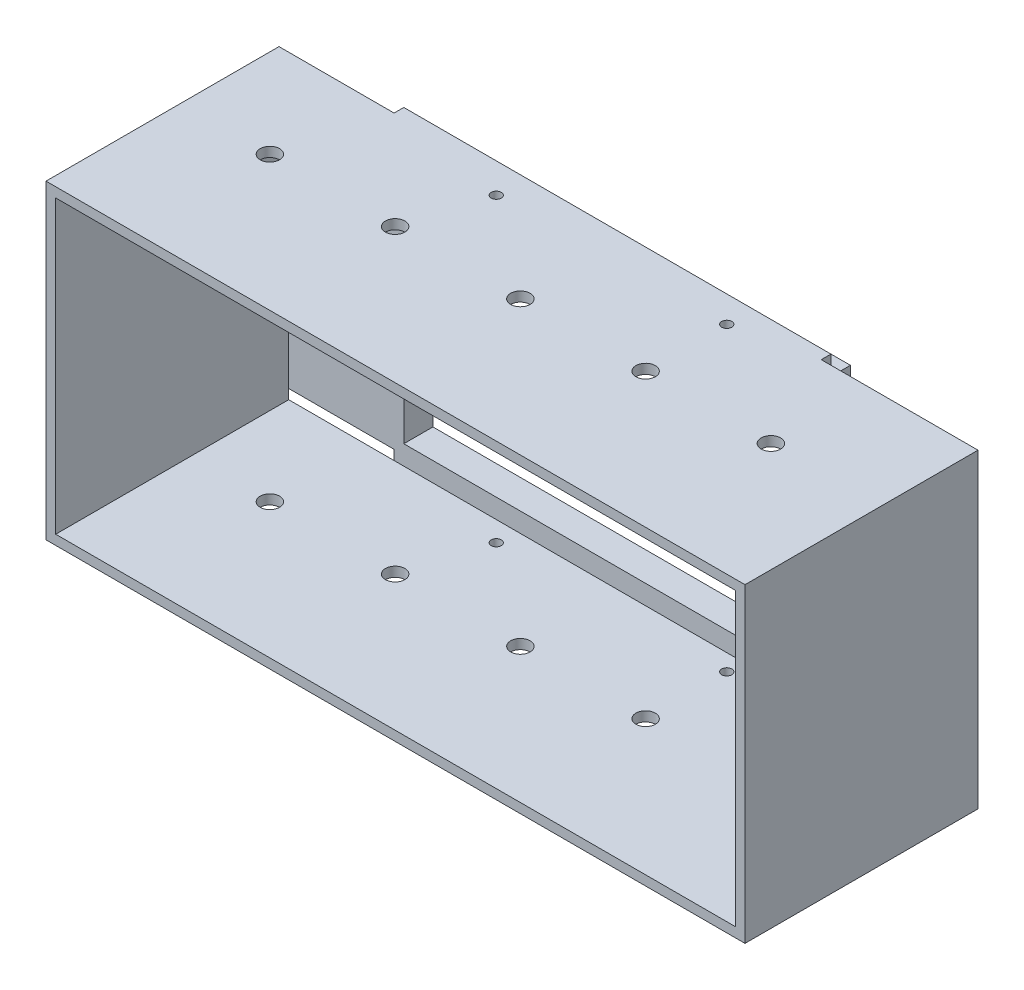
ISO-10303-21;
HEADER;
FILE_DESCRIPTION(('STEP AP214'),'2;1');
FILE_NAME('part.step','',(''),(''),'','','');
FILE_SCHEMA(('AUTOMOTIVE_DESIGN { 1 0 10303 214 1 1 1 1 }'));
ENDSEC;
DATA;
#1=APPLICATION_CONTEXT('core data for automotive mechanical design processes');
#2=APPLICATION_PROTOCOL_DEFINITION('international standard','automotive_design',2000,#1);
#3=PRODUCT_CONTEXT('',#1,'mechanical');
#4=PRODUCT('Part','Part','',(#3));
#5=PRODUCT_RELATED_PRODUCT_CATEGORY('part','',(#4));
#6=PRODUCT_DEFINITION_FORMATION('','',#4);
#7=PRODUCT_DEFINITION_CONTEXT('part definition',#1,'design');
#8=PRODUCT_DEFINITION('design','',#6,#7);
#9=PRODUCT_DEFINITION_SHAPE('','',#8);
#10=(LENGTH_UNIT() NAMED_UNIT(*) SI_UNIT(.MILLI.,.METRE.));
#11=(NAMED_UNIT(*) PLANE_ANGLE_UNIT() SI_UNIT($,.RADIAN.));
#12=(NAMED_UNIT(*) SI_UNIT($,.STERADIAN.) SOLID_ANGLE_UNIT());
#13=UNCERTAINTY_MEASURE_WITH_UNIT(LENGTH_MEASURE(1.E-05),#10,'distance_accuracy_value','');
#14=(GEOMETRIC_REPRESENTATION_CONTEXT(3) GLOBAL_UNCERTAINTY_ASSIGNED_CONTEXT((#13)) GLOBAL_UNIT_ASSIGNED_CONTEXT((#10,
#11,#12)) REPRESENTATION_CONTEXT('',''));
#15=CARTESIAN_POINT('',(0.,0.,0.));
#16=DIRECTION('',(0.,0.,1.));
#17=DIRECTION('',(1.,0.,0.));
#18=AXIS2_PLACEMENT_3D('',#15,#16,#17);
#19=CARTESIAN_POINT('',(-107.315,29.535637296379,3.175));
#20=DIRECTION('',(0.,0.,1.));
#21=DIRECTION('',(1.,0.,0.));
#22=AXIS2_PLACEMENT_3D('',#19,#20,#21);
#23=PLANE('',#22);
#24=DIRECTION('',(1.,0.,0.));
#25=VECTOR('',#24,1.);
#26=CARTESIAN_POINT('',(-66.4957712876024,-56.189362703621,3.175));
#27=LINE('',#26,#25);
#28=CARTESIAN_POINT('',(-66.4957712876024,-56.189362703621,3.175));
#29=VERTEX_POINT('',#28);
#30=CARTESIAN_POINT('',(66.8542287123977,-56.189362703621,3.175));
#31=VERTEX_POINT('',#30);
#32=EDGE_CURVE('E376',#29,#31,#27,.T.);
#33=ORIENTED_EDGE('',*,*,#32,.F.);
#34=DIRECTION('',(0.,-1.,0.));
#35=VECTOR('',#34,1.);
#36=CARTESIAN_POINT('',(-66.4957712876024,26.360637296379,3.175));
#37=LINE('',#36,#35);
#38=CARTESIAN_POINT('',(-66.4957712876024,26.360637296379,3.175));
#39=VERTEX_POINT('',#38);
#40=EDGE_CURVE('E374',#39,#29,#37,.T.);
#41=ORIENTED_EDGE('',*,*,#40,.F.);
#42=DIRECTION('',(-1.,0.,0.));
#43=VECTOR('',#42,1.);
#44=CARTESIAN_POINT('',(-66.4957712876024,26.360637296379,3.175));
#45=LINE('',#44,#43);
#46=CARTESIAN_POINT('',(66.8542287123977,26.360637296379,3.175));
#47=VERTEX_POINT('',#46);
#48=EDGE_CURVE('E381',#47,#39,#45,.T.);
#49=ORIENTED_EDGE('',*,*,#48,.F.);
#50=DIRECTION('',(0.,1.,0.));
#51=VECTOR('',#50,1.);
#52=CARTESIAN_POINT('',(66.8542287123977,26.360637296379,3.175));
#53=LINE('',#52,#51);
#54=EDGE_CURVE('E378',#31,#47,#53,.T.);
#55=ORIENTED_EDGE('',*,*,#54,.F.);
#56=EDGE_LOOP('',(#33,#41,#49,#55));
#57=FACE_BOUND('',#56,.T.);
#58=DIRECTION('',(-1.,0.,0.));
#59=VECTOR('',#58,1.);
#60=CARTESIAN_POINT('',(-69.6707712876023,29.535637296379,3.175));
#61=LINE('',#60,#59);
#62=CARTESIAN_POINT('',(-69.6707712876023,29.535637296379,3.175));
#63=VERTEX_POINT('',#62);
#64=CARTESIAN_POINT('',(-104.14,29.535637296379,3.175));
#65=VERTEX_POINT('',#64);
#66=EDGE_CURVE('E392',#63,#65,#61,.T.);
#67=ORIENTED_EDGE('',*,*,#66,.T.);
#68=DIRECTION('',(0.,-1.,0.));
#69=VECTOR('',#68,1.);
#70=CARTESIAN_POINT('',(-104.14,32.710637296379,3.175));
#71=LINE('',#70,#69);
#72=CARTESIAN_POINT('',(-104.14,-59.364362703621,3.175));
#73=VERTEX_POINT('',#72);
#74=EDGE_CURVE('E11',#65,#73,#71,.T.);
#75=ORIENTED_EDGE('',*,*,#74,.T.);
#76=DIRECTION('',(1.,0.,0.));
#77=VECTOR('',#76,1.);
#78=CARTESIAN_POINT('',(-107.315,-59.364362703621,3.175));
#79=LINE('',#78,#77);
#80=CARTESIAN_POINT('',(-69.6707712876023,-59.364362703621,3.175));
#81=VERTEX_POINT('',#80);
#82=EDGE_CURVE('E396',#73,#81,#79,.T.);
#83=ORIENTED_EDGE('',*,*,#82,.T.);
#84=DIRECTION('',(0.,-1.,0.));
#85=VECTOR('',#84,1.);
#86=CARTESIAN_POINT('',(-69.6707712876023,-59.364362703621,3.175));
#87=LINE('',#86,#85);
#88=CARTESIAN_POINT('',(-69.6707712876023,-62.539362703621,3.175));
#89=VERTEX_POINT('',#88);
#90=EDGE_CURVE('E572',#81,#89,#87,.T.);
#91=ORIENTED_EDGE('',*,*,#90,.T.);
#92=DIRECTION('',(1.,0.,0.));
#93=VECTOR('',#92,1.);
#94=CARTESIAN_POINT('',(-104.14,-62.539362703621,3.175));
#95=LINE('',#94,#93);
#96=CARTESIAN_POINT('',(70.0292287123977,-62.539362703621,3.175));
#97=VERTEX_POINT('',#96);
#98=EDGE_CURVE('E42',#89,#97,#95,.T.);
#99=ORIENTED_EDGE('',*,*,#98,.T.);
#100=DIRECTION('',(0.,1.,0.));
#101=VECTOR('',#100,1.);
#102=CARTESIAN_POINT('',(70.0292287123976,-65.714362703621,3.175));
#103=LINE('',#102,#101);
#104=CARTESIAN_POINT('',(70.0292287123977,-59.364362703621,3.175));
#105=VERTEX_POINT('',#104);
#106=EDGE_CURVE('E576',#97,#105,#103,.T.);
#107=ORIENTED_EDGE('',*,*,#106,.T.);
#108=DIRECTION('',(1.,0.,0.));
#109=VECTOR('',#108,1.);
#110=CARTESIAN_POINT('',(70.0292287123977,-59.364362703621,3.175));
#111=LINE('',#110,#109);
#112=CARTESIAN_POINT('',(76.3792287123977,-59.364362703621,3.175));
#113=VERTEX_POINT('',#112);
#114=EDGE_CURVE('E579',#105,#113,#111,.T.);
#115=ORIENTED_EDGE('',*,*,#114,.T.);
#116=DIRECTION('',(0.,1.,0.));
#117=VECTOR('',#116,1.);
#118=CARTESIAN_POINT('',(76.3792287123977,29.535637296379,3.175));
#119=LINE('',#118,#117);
#120=CARTESIAN_POINT('',(76.3792287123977,29.535637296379,3.175));
#121=VERTEX_POINT('',#120);
#122=EDGE_CURVE('E580',#113,#121,#119,.T.);
#123=ORIENTED_EDGE('',*,*,#122,.T.);
#124=DIRECTION('',(-1.,0.,0.));
#125=VECTOR('',#124,1.);
#126=CARTESIAN_POINT('',(70.0292287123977,29.535637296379,3.175));
#127=LINE('',#126,#125);
#128=CARTESIAN_POINT('',(70.0292287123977,29.535637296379,3.175));
#129=VERTEX_POINT('',#128);
#130=EDGE_CURVE('E560',#121,#129,#127,.T.);
#131=ORIENTED_EDGE('',*,*,#130,.T.);
#132=DIRECTION('',(0.,1.,0.));
#133=VECTOR('',#132,1.);
#134=CARTESIAN_POINT('',(70.0292287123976,35.885637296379,3.175));
#135=LINE('',#134,#133);
#136=CARTESIAN_POINT('',(70.0292287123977,32.710637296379,3.175));
#137=VERTEX_POINT('',#136);
#138=EDGE_CURVE('E525',#129,#137,#135,.T.);
#139=ORIENTED_EDGE('',*,*,#138,.T.);
#140=DIRECTION('',(-1.,0.,0.));
#141=VECTOR('',#140,1.);
#142=CARTESIAN_POINT('',(-104.14,32.710637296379,3.175));
#143=LINE('',#142,#141);
#144=CARTESIAN_POINT('',(-69.6707712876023,32.710637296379,3.175));
#145=VERTEX_POINT('',#144);
#146=EDGE_CURVE('E266',#137,#145,#143,.T.);
#147=ORIENTED_EDGE('',*,*,#146,.T.);
#148=DIRECTION('',(0.,-1.,0.));
#149=VECTOR('',#148,1.);
#150=CARTESIAN_POINT('',(-69.6707712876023,35.885637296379,3.175));
#151=LINE('',#150,#149);
#152=EDGE_CURVE('E519',#145,#63,#151,.T.);
#153=ORIENTED_EDGE('',*,*,#152,.T.);
#154=EDGE_LOOP('',(#67,#75,#83,#91,#99,#107,#115,#123,#131,#139,#147,#153));
#155=FACE_BOUND('',#154,.T.);
#156=ADVANCED_FACE('F33',(#57,#155),#23,.T.);
#157=CARTESIAN_POINT('',(-107.315,29.535637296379,0.));
#158=DIRECTION('',(0.,0.,1.));
#159=DIRECTION('',(1.,0.,0.));
#160=AXIS2_PLACEMENT_3D('',#157,#158,#159);
#161=PLANE('',#160);
#162=DIRECTION('',(0.,1.,0.));
#163=VECTOR('',#162,1.);
#164=CARTESIAN_POINT('',(-69.6707712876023,29.535637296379,0.));
#165=LINE('',#164,#163);
#166=CARTESIAN_POINT('',(-69.6707712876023,-59.364362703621,0.));
#167=VERTEX_POINT('',#166);
#168=CARTESIAN_POINT('',(-69.6707712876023,29.535637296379,0.));
#169=VERTEX_POINT('',#168);
#170=EDGE_CURVE('E341',#167,#169,#165,.T.);
#171=ORIENTED_EDGE('',*,*,#170,.F.);
#172=DIRECTION('',(1.,0.,0.));
#173=VECTOR('',#172,1.);
#174=CARTESIAN_POINT('',(-107.315,-59.364362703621,0.));
#175=LINE('',#174,#173);
#176=CARTESIAN_POINT('',(-107.315,-59.364362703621,0.));
#177=VERTEX_POINT('',#176);
#178=EDGE_CURVE('E674',#177,#167,#175,.T.);
#179=ORIENTED_EDGE('',*,*,#178,.F.);
#180=DIRECTION('',(0.,-1.,0.));
#181=VECTOR('',#180,1.);
#182=CARTESIAN_POINT('',(-107.315,29.535637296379,0.));
#183=LINE('',#182,#181);
#184=CARTESIAN_POINT('',(-107.315,29.535637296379,0.));
#185=VERTEX_POINT('',#184);
#186=EDGE_CURVE('E672',#185,#177,#183,.T.);
#187=ORIENTED_EDGE('',*,*,#186,.F.);
#188=DIRECTION('',(-1.,0.,0.));
#189=VECTOR('',#188,1.);
#190=CARTESIAN_POINT('',(-69.6707712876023,29.535637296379,0.));
#191=LINE('',#190,#189);
#192=EDGE_CURVE('E391',#169,#185,#191,.T.);
#193=ORIENTED_EDGE('',*,*,#192,.F.);
#194=EDGE_LOOP('',(#171,#179,#187,#193));
#195=FACE_BOUND('',#194,.T.);
#196=ADVANCED_FACE('F617',(#195),#161,.F.);
#197=DIRECTION('',(-1.,0.,0.));
#198=VECTOR('',#197,1.);
#199=CARTESIAN_POINT('',(-69.6707712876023,-59.364362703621,0.));
#200=LINE('',#199,#198);
#201=CARTESIAN_POINT('',(70.0292287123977,-59.364362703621,0.));
#202=VERTEX_POINT('',#201);
#203=EDGE_CURVE('E346',#202,#167,#200,.T.);
#204=ORIENTED_EDGE('',*,*,#203,.F.);
#205=DIRECTION('',(0.,1.,0.));
#206=VECTOR('',#205,1.);
#207=CARTESIAN_POINT('',(70.0292287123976,-65.714362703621,0.));
#208=LINE('',#207,#206);
#209=CARTESIAN_POINT('',(70.0292287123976,-65.714362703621,0.));
#210=VERTEX_POINT('',#209);
#211=EDGE_CURVE('E683',#210,#202,#208,.T.);
#212=ORIENTED_EDGE('',*,*,#211,.F.);
#213=DIRECTION('',(1.,0.,0.));
#214=VECTOR('',#213,1.);
#215=CARTESIAN_POINT('',(-69.6707712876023,-65.714362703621,0.));
#216=LINE('',#215,#214);
#217=CARTESIAN_POINT('',(-69.6707712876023,-65.714362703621,0.));
#218=VERTEX_POINT('',#217);
#219=EDGE_CURVE('E679',#218,#210,#216,.T.);
#220=ORIENTED_EDGE('',*,*,#219,.F.);
#221=DIRECTION('',(0.,-1.,0.));
#222=VECTOR('',#221,1.);
#223=CARTESIAN_POINT('',(-69.6707712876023,-59.364362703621,0.));
#224=LINE('',#223,#222);
#225=EDGE_CURVE('E677',#167,#218,#224,.T.);
#226=ORIENTED_EDGE('',*,*,#225,.F.);
#227=EDGE_LOOP('',(#204,#212,#220,#226));
#228=FACE_BOUND('',#227,.T.);
#229=ADVANCED_FACE('F623',(#228),#161,.F.);
#230=DIRECTION('',(0.,-1.,0.));
#231=VECTOR('',#230,1.);
#232=CARTESIAN_POINT('',(70.0292287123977,29.535637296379,0.));
#233=LINE('',#232,#231);
#234=CARTESIAN_POINT('',(70.0292287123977,29.535637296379,0.));
#235=VERTEX_POINT('',#234);
#236=EDGE_CURVE('E358',#235,#202,#233,.T.);
#237=ORIENTED_EDGE('',*,*,#236,.F.);
#238=DIRECTION('',(-1.,0.,0.));
#239=VECTOR('',#238,1.);
#240=CARTESIAN_POINT('',(70.0292287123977,29.535637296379,0.));
#241=LINE('',#240,#239);
#242=CARTESIAN_POINT('',(76.3792287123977,29.535637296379,0.));
#243=VERTEX_POINT('',#242);
#244=EDGE_CURVE('E590',#243,#235,#241,.T.);
#245=ORIENTED_EDGE('',*,*,#244,.F.);
#246=DIRECTION('',(0.,1.,0.));
#247=VECTOR('',#246,1.);
#248=CARTESIAN_POINT('',(76.3792287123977,29.535637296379,0.));
#249=LINE('',#248,#247);
#250=CARTESIAN_POINT('',(76.3792287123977,-59.364362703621,0.));
#251=VERTEX_POINT('',#250);
#252=EDGE_CURVE('E688',#251,#243,#249,.T.);
#253=ORIENTED_EDGE('',*,*,#252,.F.);
#254=DIRECTION('',(1.,0.,0.));
#255=VECTOR('',#254,1.);
#256=CARTESIAN_POINT('',(70.0292287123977,-59.364362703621,0.));
#257=LINE('',#256,#255);
#258=EDGE_CURVE('E686',#202,#251,#257,.T.);
#259=ORIENTED_EDGE('',*,*,#258,.F.);
#260=EDGE_LOOP('',(#237,#245,#253,#259));
#261=FACE_BOUND('',#260,.T.);
#262=ADVANCED_FACE('F725',(#261),#161,.F.);
#263=DIRECTION('',(1.,0.,0.));
#264=VECTOR('',#263,1.);
#265=CARTESIAN_POINT('',(-69.6707712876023,29.535637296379,0.));
#266=LINE('',#265,#264);
#267=EDGE_CURVE('E355',#169,#235,#266,.T.);
#268=ORIENTED_EDGE('',*,*,#267,.F.);
#269=DIRECTION('',(0.,-1.,0.));
#270=VECTOR('',#269,1.);
#271=CARTESIAN_POINT('',(-69.6707712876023,35.885637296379,0.));
#272=LINE('',#271,#270);
#273=CARTESIAN_POINT('',(-69.6707712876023,35.885637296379,0.));
#274=VERTEX_POINT('',#273);
#275=EDGE_CURVE('E403',#274,#169,#272,.T.);
#276=ORIENTED_EDGE('',*,*,#275,.F.);
#277=DIRECTION('',(-1.,0.,0.));
#278=VECTOR('',#277,1.);
#279=CARTESIAN_POINT('',(-69.6707712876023,35.885637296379,0.));
#280=LINE('',#279,#278);
#281=CARTESIAN_POINT('',(70.0292287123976,35.885637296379,0.));
#282=VERTEX_POINT('',#281);
#283=EDGE_CURVE('E692',#282,#274,#280,.T.);
#284=ORIENTED_EDGE('',*,*,#283,.F.);
#285=DIRECTION('',(0.,1.,0.));
#286=VECTOR('',#285,1.);
#287=CARTESIAN_POINT('',(70.0292287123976,35.885637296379,0.));
#288=LINE('',#287,#286);
#289=EDGE_CURVE('E691',#235,#282,#288,.T.);
#290=ORIENTED_EDGE('',*,*,#289,.F.);
#291=EDGE_LOOP('',(#268,#276,#284,#290));
#292=FACE_BOUND('',#291,.T.);
#293=ADVANCED_FACE('F626',(#292),#161,.F.);
#294=CARTESIAN_POINT('',(-69.6707712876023,29.535637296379,3.175));
#295=DIRECTION('',(0.,-1.,0.));
#296=DIRECTION('',(1.,0.,0.));
#297=AXIS2_PLACEMENT_3D('',#294,#295,#296);
#298=PLANE('',#297);
#299=ORIENTED_EDGE('',*,*,#192,.T.);
#300=DIRECTION('',(0.,0.,-1.));
#301=VECTOR('',#300,1.);
#302=CARTESIAN_POINT('',(-107.315,29.535637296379,3.175));
#303=LINE('',#302,#301);
#304=CARTESIAN_POINT('',(-107.315,29.535637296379,3.175));
#305=VERTEX_POINT('',#304);
#306=EDGE_CURVE('E407',#305,#185,#303,.T.);
#307=ORIENTED_EDGE('',*,*,#306,.F.);
#308=EDGE_CURVE('E397',#65,#305,#61,.T.);
#309=ORIENTED_EDGE('',*,*,#308,.F.);
#310=ORIENTED_EDGE('',*,*,#66,.F.);
#311=DIRECTION('',(0.,0.,-1.));
#312=VECTOR('',#311,1.);
#313=CARTESIAN_POINT('',(-69.6707712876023,29.535637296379,3.175));
#314=LINE('',#313,#312);
#315=EDGE_CURVE('E528',#63,#169,#314,.T.);
#316=ORIENTED_EDGE('',*,*,#315,.T.);
#317=EDGE_LOOP('',(#299,#307,#309,#310,#316));
#318=FACE_BOUND('',#317,.T.);
#319=ADVANCED_FACE('F35',(#318),#298,.F.);
#320=CARTESIAN_POINT('',(-107.315,29.535637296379,3.175));
#321=DIRECTION('',(1.,0.,0.));
#322=DIRECTION('',(0.,1.,0.));
#323=AXIS2_PLACEMENT_3D('',#320,#321,#322);
#324=PLANE('',#323);
#325=ORIENTED_EDGE('',*,*,#186,.T.);
#326=DIRECTION('',(0.,0.,-1.));
#327=VECTOR('',#326,1.);
#328=CARTESIAN_POINT('',(-107.315,-59.364362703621,3.175));
#329=LINE('',#328,#327);
#330=CARTESIAN_POINT('',(-107.315,-59.364362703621,3.175));
#331=VERTEX_POINT('',#330);
#332=EDGE_CURVE('E410',#331,#177,#329,.T.);
#333=ORIENTED_EDGE('',*,*,#332,.F.);
#334=DIRECTION('',(0.,-1.,0.));
#335=VECTOR('',#334,1.);
#336=CARTESIAN_POINT('',(-107.315,35.885637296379,3.175));
#337=LINE('',#336,#335);
#338=CARTESIAN_POINT('',(-107.315,-65.714362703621,3.175));
#339=VERTEX_POINT('',#338);
#340=EDGE_CURVE('E246',#331,#339,#337,.T.);
#341=ORIENTED_EDGE('',*,*,#340,.T.);
#342=DIRECTION('',(0.,0.,-1.));
#343=VECTOR('',#342,1.);
#344=CARTESIAN_POINT('',(-107.315,-65.714362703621,79.375));
#345=LINE('',#344,#343);
#346=CARTESIAN_POINT('',(-107.315,-65.714362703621,79.375));
#347=VERTEX_POINT('',#346);
#348=EDGE_CURVE('E294',#347,#339,#345,.T.);
#349=ORIENTED_EDGE('',*,*,#348,.F.);
#350=DIRECTION('',(0.,-1.,0.));
#351=VECTOR('',#350,1.);
#352=CARTESIAN_POINT('',(-107.315,35.885637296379,79.375));
#353=LINE('',#352,#351);
#354=CARTESIAN_POINT('',(-107.315,35.885637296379,79.375));
#355=VERTEX_POINT('',#354);
#356=EDGE_CURVE('E271',#355,#347,#353,.T.);
#357=ORIENTED_EDGE('',*,*,#356,.F.);
#358=DIRECTION('',(0.,0.,-1.));
#359=VECTOR('',#358,1.);
#360=CARTESIAN_POINT('',(-107.315,35.885637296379,79.375));
#361=LINE('',#360,#359);
#362=CARTESIAN_POINT('',(-107.315,35.885637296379,3.175));
#363=VERTEX_POINT('',#362);
#364=EDGE_CURVE('E281',#355,#363,#361,.T.);
#365=ORIENTED_EDGE('',*,*,#364,.T.);
#366=EDGE_CURVE('E290',#363,#305,#337,.T.);
#367=ORIENTED_EDGE('',*,*,#366,.T.);
#368=ORIENTED_EDGE('',*,*,#306,.T.);
#369=EDGE_LOOP('',(#325,#333,#341,#349,#357,#365,#367,#368));
#370=FACE_BOUND('',#369,.T.);
#371=ADVANCED_FACE('F664',(#370),#324,.F.);
#372=CARTESIAN_POINT('',(-107.315,-59.364362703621,3.175));
#373=DIRECTION('',(0.,1.,0.));
#374=DIRECTION('',(0.,0.,1.));
#375=AXIS2_PLACEMENT_3D('',#372,#373,#374);
#376=PLANE('',#375);
#377=ORIENTED_EDGE('',*,*,#178,.T.);
#378=DIRECTION('',(0.,0.,-1.));
#379=VECTOR('',#378,1.);
#380=CARTESIAN_POINT('',(-69.6707712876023,-59.364362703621,3.175));
#381=LINE('',#380,#379);
#382=EDGE_CURVE('E415',#81,#167,#381,.T.);
#383=ORIENTED_EDGE('',*,*,#382,.F.);
#384=ORIENTED_EDGE('',*,*,#82,.F.);
#385=EDGE_CURVE('E418',#331,#73,#79,.T.);
#386=ORIENTED_EDGE('',*,*,#385,.F.);
#387=ORIENTED_EDGE('',*,*,#332,.T.);
#388=EDGE_LOOP('',(#377,#383,#384,#386,#387));
#389=FACE_BOUND('',#388,.T.);
#390=ADVANCED_FACE('F661',(#389),#376,.F.);
#391=CARTESIAN_POINT('',(-69.6707712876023,-59.364362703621,3.175));
#392=DIRECTION('',(1.,0.,0.));
#393=DIRECTION('',(0.,0.,-1.));
#394=AXIS2_PLACEMENT_3D('',#391,#392,#393);
#395=PLANE('',#394);
#396=ORIENTED_EDGE('',*,*,#225,.T.);
#397=DIRECTION('',(0.,0.,-1.));
#398=VECTOR('',#397,1.);
#399=CARTESIAN_POINT('',(-69.6707712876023,-65.714362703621,3.175));
#400=LINE('',#399,#398);
#401=CARTESIAN_POINT('',(-69.6707712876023,-65.714362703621,3.175));
#402=VERTEX_POINT('',#401);
#403=EDGE_CURVE('E556',#402,#218,#400,.T.);
#404=ORIENTED_EDGE('',*,*,#403,.F.);
#405=EDGE_CURVE('E421',#89,#402,#87,.T.);
#406=ORIENTED_EDGE('',*,*,#405,.F.);
#407=ORIENTED_EDGE('',*,*,#90,.F.);
#408=ORIENTED_EDGE('',*,*,#382,.T.);
#409=EDGE_LOOP('',(#396,#404,#406,#407,#408));
#410=FACE_BOUND('',#409,.T.);
#411=ADVANCED_FACE('F657',(#410),#395,.F.);
#412=CARTESIAN_POINT('',(-69.6707712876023,-65.714362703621,3.175));
#413=DIRECTION('',(0.,1.,0.));
#414=DIRECTION('',(0.,0.,1.));
#415=AXIS2_PLACEMENT_3D('',#412,#413,#414);
#416=PLANE('',#415);
#417=CARTESIAN_POINT('',(44.5642541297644,-65.714362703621,8.62178556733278));
#418=DIRECTION('',(0.,-1.,0.));
#419=DIRECTION('',(0.,0.,-1.));
#420=AXIS2_PLACEMENT_3D('',#417,#418,#419);
#421=CIRCLE('',#420,1.651);
#422=CARTESIAN_POINT('',(44.5642541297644,-65.714362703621,6.97078556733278));
#423=VERTEX_POINT('',#422);
#424=EDGE_CURVE('E1108',#423,#423,#421,.T.);
#425=ORIENTED_EDGE('',*,*,#424,.F.);
#426=EDGE_LOOP('',(#425));
#427=FACE_BOUND('',#426,.T.);
#428=CARTESIAN_POINT('',(-29.7030733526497,-65.714362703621,9.75057121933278));
#429=DIRECTION('',(0.,-1.,0.));
#430=DIRECTION('',(0.,0.,-1.));
#431=AXIS2_PLACEMENT_3D('',#428,#429,#430);
#432=CIRCLE('',#431,1.651);
#433=CARTESIAN_POINT('',(-29.7030733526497,-65.714362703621,8.09957121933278));
#434=VERTEX_POINT('',#433);
#435=EDGE_CURVE('E449',#434,#434,#432,.T.);
#436=ORIENTED_EDGE('',*,*,#435,.F.);
#437=EDGE_LOOP('',(#436));
#438=FACE_BOUND('',#437,.T.);
#439=CARTESIAN_POINT('',(85.5259874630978,-65.714362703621,35.1505712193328));
#440=DIRECTION('',(0.,-1.,0.));
#441=DIRECTION('',(0.,0.,-1.));
#442=AXIS2_PLACEMENT_3D('',#439,#440,#441);
#443=CIRCLE('',#442,3.175);
#444=CARTESIAN_POINT('',(85.5259874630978,-65.714362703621,31.9755712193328));
#445=VERTEX_POINT('',#444);
#446=EDGE_CURVE('E445',#445,#445,#443,.T.);
#447=ORIENTED_EDGE('',*,*,#446,.F.);
#448=EDGE_LOOP('',(#447));
#449=FACE_BOUND('',#448,.T.);
#450=CARTESIAN_POINT('',(44.5642541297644,-65.714362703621,35.1505712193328));
#451=DIRECTION('',(0.,-1.,0.));
#452=DIRECTION('',(0.,0.,-1.));
#453=AXIS2_PLACEMENT_3D('',#450,#451,#452);
#454=CIRCLE('',#453,3.175);
#455=CARTESIAN_POINT('',(44.5642541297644,-65.714362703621,31.9755712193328));
#456=VERTEX_POINT('',#455);
#457=EDGE_CURVE('E441',#456,#456,#454,.T.);
#458=ORIENTED_EDGE('',*,*,#457,.F.);
#459=EDGE_LOOP('',(#458));
#460=FACE_BOUND('',#459,.T.);
#461=CARTESIAN_POINT('',(3.6025207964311,-65.714362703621,35.1505712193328));
#462=DIRECTION('',(0.,-1.,0.));
#463=DIRECTION('',(0.,0.,-1.));
#464=AXIS2_PLACEMENT_3D('',#461,#462,#463);
#465=CIRCLE('',#464,3.175);
#466=CARTESIAN_POINT('',(3.6025207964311,-65.714362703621,31.9755712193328));
#467=VERTEX_POINT('',#466);
#468=EDGE_CURVE('E436',#467,#467,#465,.T.);
#469=ORIENTED_EDGE('',*,*,#468,.F.);
#470=EDGE_LOOP('',(#469));
#471=FACE_BOUND('',#470,.T.);
#472=CARTESIAN_POINT('',(-37.3592125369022,-65.714362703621,35.1505712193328));
#473=DIRECTION('',(0.,-1.,0.));
#474=DIRECTION('',(0.,0.,-1.));
#475=AXIS2_PLACEMENT_3D('',#472,#473,#474);
#476=CIRCLE('',#475,3.175);
#477=CARTESIAN_POINT('',(-37.3592125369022,-65.714362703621,31.9755712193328));
#478=VERTEX_POINT('',#477);
#479=EDGE_CURVE('E431',#478,#478,#476,.T.);
#480=ORIENTED_EDGE('',*,*,#479,.F.);
#481=EDGE_LOOP('',(#480));
#482=FACE_BOUND('',#481,.T.);
#483=CARTESIAN_POINT('',(-78.3209458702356,-65.714362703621,35.1505712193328));
#484=DIRECTION('',(0.,-1.,0.));
#485=DIRECTION('',(0.,0.,-1.));
#486=AXIS2_PLACEMENT_3D('',#483,#484,#485);
#487=CIRCLE('',#486,3.175);
#488=CARTESIAN_POINT('',(-78.3209458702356,-65.714362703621,31.9755712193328));
#489=VERTEX_POINT('',#488);
#490=EDGE_CURVE('E426',#489,#489,#487,.T.);
#491=ORIENTED_EDGE('',*,*,#490,.F.);
#492=EDGE_LOOP('',(#491));
#493=FACE_BOUND('',#492,.T.);
#494=ORIENTED_EDGE('',*,*,#219,.T.);
#495=DIRECTION('',(0.,0.,-1.));
#496=VECTOR('',#495,1.);
#497=CARTESIAN_POINT('',(70.0292287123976,-65.714362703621,3.175));
#498=LINE('',#497,#496);
#499=CARTESIAN_POINT('',(70.0292287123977,-65.714362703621,3.175));
#500=VERTEX_POINT('',#499);
#501=EDGE_CURVE('E553',#500,#210,#498,.T.);
#502=ORIENTED_EDGE('',*,*,#501,.F.);
#503=DIRECTION('',(1.,0.,0.));
#504=VECTOR('',#503,1.);
#505=CARTESIAN_POINT('',(-107.315,-65.714362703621,3.175));
#506=LINE('',#505,#504);
#507=CARTESIAN_POINT('',(121.285,-65.714362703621,3.175));
#508=VERTEX_POINT('',#507);
#509=EDGE_CURVE('E293',#500,#508,#506,.T.);
#510=ORIENTED_EDGE('',*,*,#509,.T.);
#511=DIRECTION('',(0.,0.,-1.));
#512=VECTOR('',#511,1.);
#513=CARTESIAN_POINT('',(121.285,-65.714362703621,79.375));
#514=LINE('',#513,#512);
#515=CARTESIAN_POINT('',(121.285,-65.714362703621,79.375));
#516=VERTEX_POINT('',#515);
#517=EDGE_CURVE('E298',#516,#508,#514,.T.);
#518=ORIENTED_EDGE('',*,*,#517,.F.);
#519=DIRECTION('',(1.,0.,0.));
#520=VECTOR('',#519,1.);
#521=CARTESIAN_POINT('',(-107.315,-65.714362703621,79.375));
#522=LINE('',#521,#520);
#523=EDGE_CURVE('E274',#347,#516,#522,.T.);
#524=ORIENTED_EDGE('',*,*,#523,.F.);
#525=ORIENTED_EDGE('',*,*,#348,.T.);
#526=EDGE_CURVE('E319',#339,#402,#506,.T.);
#527=ORIENTED_EDGE('',*,*,#526,.T.);
#528=ORIENTED_EDGE('',*,*,#403,.T.);
#529=EDGE_LOOP('',(#494,#502,#510,#518,#524,#525,#527,#528));
#530=FACE_BOUND('',#529,.T.);
#531=ADVANCED_FACE('F653',(#427,#438,#449,#460,#471,#482,#493,#530),#416,.F.);
#532=CARTESIAN_POINT('',(70.0292287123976,-65.714362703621,3.175));
#533=DIRECTION('',(-1.,0.,0.));
#534=DIRECTION('',(0.,-1.,0.));
#535=AXIS2_PLACEMENT_3D('',#532,#533,#534);
#536=PLANE('',#535);
#537=ORIENTED_EDGE('',*,*,#211,.T.);
#538=DIRECTION('',(0.,0.,-1.));
#539=VECTOR('',#538,1.);
#540=CARTESIAN_POINT('',(70.0292287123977,-59.364362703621,3.175));
#541=LINE('',#540,#539);
#542=EDGE_CURVE('E550',#105,#202,#541,.T.);
#543=ORIENTED_EDGE('',*,*,#542,.F.);
#544=ORIENTED_EDGE('',*,*,#106,.F.);
#545=EDGE_CURVE('E404',#500,#97,#103,.T.);
#546=ORIENTED_EDGE('',*,*,#545,.F.);
#547=ORIENTED_EDGE('',*,*,#501,.T.);
#548=EDGE_LOOP('',(#537,#543,#544,#546,#547));
#549=FACE_BOUND('',#548,.T.);
#550=ADVANCED_FACE('F649',(#549),#536,.F.);
#551=CARTESIAN_POINT('',(70.0292287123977,-59.364362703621,3.175));
#552=DIRECTION('',(0.,1.,0.));
#553=DIRECTION('',(0.,0.,1.));
#554=AXIS2_PLACEMENT_3D('',#551,#552,#553);
#555=PLANE('',#554);
#556=ORIENTED_EDGE('',*,*,#258,.T.);
#557=DIRECTION('',(0.,0.,-1.));
#558=VECTOR('',#557,1.);
#559=CARTESIAN_POINT('',(76.3792287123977,-59.364362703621,3.175));
#560=LINE('',#559,#558);
#561=EDGE_CURVE('E547',#113,#251,#560,.T.);
#562=ORIENTED_EDGE('',*,*,#561,.F.);
#563=ORIENTED_EDGE('',*,*,#114,.F.);
#564=ORIENTED_EDGE('',*,*,#542,.T.);
#565=EDGE_LOOP('',(#556,#562,#563,#564));
#566=FACE_BOUND('',#565,.T.);
#567=ADVANCED_FACE('F645',(#566),#555,.F.);
#568=CARTESIAN_POINT('',(76.3792287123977,29.535637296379,3.175));
#569=DIRECTION('',(-1.,0.,0.));
#570=DIRECTION('',(0.,0.,1.));
#571=AXIS2_PLACEMENT_3D('',#568,#569,#570);
#572=PLANE('',#571);
#573=ORIENTED_EDGE('',*,*,#252,.T.);
#574=DIRECTION('',(0.,0.,-1.));
#575=VECTOR('',#574,1.);
#576=CARTESIAN_POINT('',(76.3792287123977,29.535637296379,3.175));
#577=LINE('',#576,#575);
#578=EDGE_CURVE('E544',#121,#243,#577,.T.);
#579=ORIENTED_EDGE('',*,*,#578,.F.);
#580=ORIENTED_EDGE('',*,*,#122,.F.);
#581=ORIENTED_EDGE('',*,*,#561,.T.);
#582=EDGE_LOOP('',(#573,#579,#580,#581));
#583=FACE_BOUND('',#582,.T.);
#584=ADVANCED_FACE('F642',(#583),#572,.F.);
#585=CARTESIAN_POINT('',(70.0292287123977,29.535637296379,3.175));
#586=DIRECTION('',(0.,-1.,0.));
#587=DIRECTION('',(0.,0.,-1.));
#588=AXIS2_PLACEMENT_3D('',#585,#586,#587);
#589=PLANE('',#588);
#590=ORIENTED_EDGE('',*,*,#244,.T.);
#591=DIRECTION('',(0.,0.,-1.));
#592=VECTOR('',#591,1.);
#593=CARTESIAN_POINT('',(70.0292287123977,29.535637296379,3.175));
#594=LINE('',#593,#592);
#595=EDGE_CURVE('E541',#129,#235,#594,.T.);
#596=ORIENTED_EDGE('',*,*,#595,.F.);
#597=ORIENTED_EDGE('',*,*,#130,.F.);
#598=ORIENTED_EDGE('',*,*,#578,.T.);
#599=EDGE_LOOP('',(#590,#596,#597,#598));
#600=FACE_BOUND('',#599,.T.);
#601=ADVANCED_FACE('F588',(#600),#589,.F.);
#602=CARTESIAN_POINT('',(70.0292287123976,35.885637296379,3.175));
#603=DIRECTION('',(-1.,0.,0.));
#604=DIRECTION('',(0.,-1.,0.));
#605=AXIS2_PLACEMENT_3D('',#602,#603,#604);
#606=PLANE('',#605);
#607=ORIENTED_EDGE('',*,*,#289,.T.);
#608=DIRECTION('',(0.,0.,-1.));
#609=VECTOR('',#608,1.);
#610=CARTESIAN_POINT('',(70.0292287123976,35.885637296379,3.175));
#611=LINE('',#610,#609);
#612=CARTESIAN_POINT('',(70.0292287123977,35.885637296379,3.175));
#613=VERTEX_POINT('',#612);
#614=EDGE_CURVE('E535',#613,#282,#611,.T.);
#615=ORIENTED_EDGE('',*,*,#614,.F.);
#616=EDGE_CURVE('E557',#137,#613,#135,.T.);
#617=ORIENTED_EDGE('',*,*,#616,.F.);
#618=ORIENTED_EDGE('',*,*,#138,.F.);
#619=ORIENTED_EDGE('',*,*,#595,.T.);
#620=EDGE_LOOP('',(#607,#615,#617,#618,#619));
#621=FACE_BOUND('',#620,.T.);
#622=ADVANCED_FACE('F594',(#621),#606,.F.);
#623=CARTESIAN_POINT('',(-69.6707712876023,35.885637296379,3.175));
#624=DIRECTION('',(0.,-1.,0.));
#625=DIRECTION('',(0.,0.,-1.));
#626=AXIS2_PLACEMENT_3D('',#623,#624,#625);
#627=PLANE('',#626);
#628=CARTESIAN_POINT('',(44.5642541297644,35.885637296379,8.62178556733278));
#629=DIRECTION('',(0.,-1.,0.));
#630=DIRECTION('',(0.,0.,-1.));
#631=AXIS2_PLACEMENT_3D('',#628,#629,#630);
#632=CIRCLE('',#631,1.651);
#633=CARTESIAN_POINT('',(44.5642541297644,35.885637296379,6.97078556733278));
#634=VERTEX_POINT('',#633);
#635=EDGE_CURVE('E456',#634,#634,#632,.T.);
#636=ORIENTED_EDGE('',*,*,#635,.T.);
#637=EDGE_LOOP('',(#636));
#638=FACE_BOUND('',#637,.T.);
#639=CARTESIAN_POINT('',(-29.7030733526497,35.885637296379,9.75057121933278));
#640=DIRECTION('',(0.,-1.,0.));
#641=DIRECTION('',(0.,0.,-1.));
#642=AXIS2_PLACEMENT_3D('',#639,#640,#641);
#643=CIRCLE('',#642,1.651);
#644=CARTESIAN_POINT('',(-29.7030733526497,35.885637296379,8.09957121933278));
#645=VERTEX_POINT('',#644);
#646=EDGE_CURVE('E453',#645,#645,#643,.T.);
#647=ORIENTED_EDGE('',*,*,#646,.T.);
#648=EDGE_LOOP('',(#647));
#649=FACE_BOUND('',#648,.T.);
#650=CARTESIAN_POINT('',(85.5259874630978,35.885637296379,35.1505712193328));
#651=DIRECTION('',(0.,-1.,0.));
#652=DIRECTION('',(0.,0.,-1.));
#653=AXIS2_PLACEMENT_3D('',#650,#651,#652);
#654=CIRCLE('',#653,3.175);
#655=CARTESIAN_POINT('',(85.5259874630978,35.885637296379,31.9755712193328));
#656=VERTEX_POINT('',#655);
#657=EDGE_CURVE('E471',#656,#656,#654,.T.);
#658=ORIENTED_EDGE('',*,*,#657,.T.);
#659=EDGE_LOOP('',(#658));
#660=FACE_BOUND('',#659,.T.);
#661=CARTESIAN_POINT('',(44.5642541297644,35.885637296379,35.1505712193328));
#662=DIRECTION('',(0.,-1.,0.));
#663=DIRECTION('',(0.,0.,-1.));
#664=AXIS2_PLACEMENT_3D('',#661,#662,#663);
#665=CIRCLE('',#664,3.175);
#666=CARTESIAN_POINT('',(44.5642541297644,35.885637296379,31.9755712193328));
#667=VERTEX_POINT('',#666);
#668=EDGE_CURVE('E478',#667,#667,#665,.T.);
#669=ORIENTED_EDGE('',*,*,#668,.T.);
#670=EDGE_LOOP('',(#669));
#671=FACE_BOUND('',#670,.T.);
#672=CARTESIAN_POINT('',(3.6025207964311,35.885637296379,35.1505712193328));
#673=DIRECTION('',(0.,-1.,0.));
#674=DIRECTION('',(0.,0.,-1.));
#675=AXIS2_PLACEMENT_3D('',#672,#673,#674);
#676=CIRCLE('',#675,3.175);
#677=CARTESIAN_POINT('',(3.6025207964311,35.885637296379,31.9755712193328));
#678=VERTEX_POINT('',#677);
#679=EDGE_CURVE('E485',#678,#678,#676,.T.);
#680=ORIENTED_EDGE('',*,*,#679,.T.);
#681=EDGE_LOOP('',(#680));
#682=FACE_BOUND('',#681,.T.);
#683=CARTESIAN_POINT('',(-37.3592125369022,35.885637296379,35.1505712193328));
#684=DIRECTION('',(0.,-1.,0.));
#685=DIRECTION('',(0.,0.,-1.));
#686=AXIS2_PLACEMENT_3D('',#683,#684,#685);
#687=CIRCLE('',#686,3.175);
#688=CARTESIAN_POINT('',(-37.3592125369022,35.885637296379,31.9755712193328));
#689=VERTEX_POINT('',#688);
#690=EDGE_CURVE('E492',#689,#689,#687,.T.);
#691=ORIENTED_EDGE('',*,*,#690,.T.);
#692=EDGE_LOOP('',(#691));
#693=FACE_BOUND('',#692,.T.);
#694=CARTESIAN_POINT('',(-78.3209458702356,35.885637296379,35.1505712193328));
#695=DIRECTION('',(0.,-1.,0.));
#696=DIRECTION('',(0.,0.,-1.));
#697=AXIS2_PLACEMENT_3D('',#694,#695,#696);
#698=CIRCLE('',#697,3.175);
#699=CARTESIAN_POINT('',(-78.3209458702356,35.885637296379,31.9755712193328));
#700=VERTEX_POINT('',#699);
#701=EDGE_CURVE('E498',#700,#700,#698,.T.);
#702=ORIENTED_EDGE('',*,*,#701,.T.);
#703=EDGE_LOOP('',(#702));
#704=FACE_BOUND('',#703,.T.);
#705=ORIENTED_EDGE('',*,*,#283,.T.);
#706=DIRECTION('',(0.,0.,-1.));
#707=VECTOR('',#706,1.);
#708=CARTESIAN_POINT('',(-69.6707712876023,35.885637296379,3.175));
#709=LINE('',#708,#707);
#710=CARTESIAN_POINT('',(-69.6707712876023,35.885637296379,3.175));
#711=VERTEX_POINT('',#710);
#712=EDGE_CURVE('E533',#711,#274,#709,.T.);
#713=ORIENTED_EDGE('',*,*,#712,.F.);
#714=DIRECTION('',(-1.,0.,0.));
#715=VECTOR('',#714,1.);
#716=CARTESIAN_POINT('',(-107.315,35.885637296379,3.175));
#717=LINE('',#716,#715);
#718=EDGE_CURVE('E310',#711,#363,#717,.T.);
#719=ORIENTED_EDGE('',*,*,#718,.T.);
#720=ORIENTED_EDGE('',*,*,#364,.F.);
#721=DIRECTION('',(-1.,0.,0.));
#722=VECTOR('',#721,1.);
#723=CARTESIAN_POINT('',(-107.315,35.885637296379,79.375));
#724=LINE('',#723,#722);
#725=CARTESIAN_POINT('',(121.285,35.885637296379,79.375));
#726=VERTEX_POINT('',#725);
#727=EDGE_CURVE('E279',#726,#355,#724,.T.);
#728=ORIENTED_EDGE('',*,*,#727,.F.);
#729=DIRECTION('',(0.,0.,-1.));
#730=VECTOR('',#729,1.);
#731=CARTESIAN_POINT('',(121.285,35.885637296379,79.375));
#732=LINE('',#731,#730);
#733=CARTESIAN_POINT('',(121.285,35.885637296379,3.175));
#734=VERTEX_POINT('',#733);
#735=EDGE_CURVE('E301',#726,#734,#732,.T.);
#736=ORIENTED_EDGE('',*,*,#735,.T.);
#737=EDGE_CURVE('E275',#734,#613,#717,.T.);
#738=ORIENTED_EDGE('',*,*,#737,.T.);
#739=ORIENTED_EDGE('',*,*,#614,.T.);
#740=EDGE_LOOP('',(#705,#713,#719,#720,#728,#736,#738,#739));
#741=FACE_BOUND('',#740,.T.);
#742=ADVANCED_FACE('F634',(#638,#649,#660,#671,#682,#693,#704,#741),#627,.F.);
#743=CARTESIAN_POINT('',(-69.6707712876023,35.885637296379,3.175));
#744=DIRECTION('',(1.,0.,0.));
#745=DIRECTION('',(0.,0.,-1.));
#746=AXIS2_PLACEMENT_3D('',#743,#744,#745);
#747=PLANE('',#746);
#748=ORIENTED_EDGE('',*,*,#275,.T.);
#749=ORIENTED_EDGE('',*,*,#315,.F.);
#750=ORIENTED_EDGE('',*,*,#152,.F.);
#751=EDGE_CURVE('E524',#711,#145,#151,.T.);
#752=ORIENTED_EDGE('',*,*,#751,.F.);
#753=ORIENTED_EDGE('',*,*,#712,.T.);
#754=EDGE_LOOP('',(#748,#749,#750,#752,#753));
#755=FACE_BOUND('',#754,.T.);
#756=ADVANCED_FACE('F529',(#755),#747,.F.);
#757=CARTESIAN_POINT('',(-66.4957712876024,26.360637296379,3.175));
#758=DIRECTION('',(1.,0.,0.));
#759=DIRECTION('',(0.,0.,-1.));
#760=AXIS2_PLACEMENT_3D('',#757,#758,#759);
#761=PLANE('',#760);
#762=DIRECTION('',(0.,0.,-1.));
#763=VECTOR('',#762,1.);
#764=CARTESIAN_POINT('',(-66.4957712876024,-56.189362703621,3.175));
#765=LINE('',#764,#763);
#766=CARTESIAN_POINT('',(-66.4957712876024,-56.189362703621,-6.35));
#767=VERTEX_POINT('',#766);
#768=EDGE_CURVE('E389',#29,#767,#765,.T.);
#769=ORIENTED_EDGE('',*,*,#768,.T.);
#770=DIRECTION('',(0.,1.,0.));
#771=VECTOR('',#770,1.);
#772=CARTESIAN_POINT('',(-66.4957712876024,26.360637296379,-6.35));
#773=LINE('',#772,#771);
#774=CARTESIAN_POINT('',(-66.4957712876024,26.360637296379,-6.35));
#775=VERTEX_POINT('',#774);
#776=EDGE_CURVE('E297',#767,#775,#773,.T.);
#777=ORIENTED_EDGE('',*,*,#776,.T.);
#778=DIRECTION('',(0.,0.,-1.));
#779=VECTOR('',#778,1.);
#780=CARTESIAN_POINT('',(-66.4957712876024,26.360637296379,3.175));
#781=LINE('',#780,#779);
#782=EDGE_CURVE('E383',#39,#775,#781,.T.);
#783=ORIENTED_EDGE('',*,*,#782,.F.);
#784=ORIENTED_EDGE('',*,*,#40,.T.);
#785=EDGE_LOOP('',(#769,#777,#783,#784));
#786=FACE_BOUND('',#785,.T.);
#787=ADVANCED_FACE('F629',(#786),#761,.T.);
#788=CARTESIAN_POINT('',(-66.4957712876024,-56.189362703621,3.175));
#789=DIRECTION('',(0.,1.,0.));
#790=DIRECTION('',(0.,0.,1.));
#791=AXIS2_PLACEMENT_3D('',#788,#789,#790);
#792=PLANE('',#791);
#793=DIRECTION('',(0.,0.,-1.));
#794=VECTOR('',#793,1.);
#795=CARTESIAN_POINT('',(66.8542287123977,-56.189362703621,3.175));
#796=LINE('',#795,#794);
#797=CARTESIAN_POINT('',(66.8542287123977,-56.189362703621,-6.35));
#798=VERTEX_POINT('',#797);
#799=EDGE_CURVE('E387',#31,#798,#796,.T.);
#800=ORIENTED_EDGE('',*,*,#799,.T.);
#801=DIRECTION('',(-1.,0.,0.));
#802=VECTOR('',#801,1.);
#803=CARTESIAN_POINT('',(-66.4957712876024,-56.189362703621,-6.35));
#804=LINE('',#803,#802);
#805=EDGE_CURVE('E338',#798,#767,#804,.T.);
#806=ORIENTED_EDGE('',*,*,#805,.T.);
#807=ORIENTED_EDGE('',*,*,#768,.F.);
#808=ORIENTED_EDGE('',*,*,#32,.T.);
#809=EDGE_LOOP('',(#800,#806,#807,#808));
#810=FACE_BOUND('',#809,.T.);
#811=ADVANCED_FACE('F854',(#810),#792,.T.);
#812=CARTESIAN_POINT('',(66.8542287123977,26.360637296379,3.175));
#813=DIRECTION('',(-1.,0.,0.));
#814=DIRECTION('',(0.,-1.,0.));
#815=AXIS2_PLACEMENT_3D('',#812,#813,#814);
#816=PLANE('',#815);
#817=DIRECTION('',(0.,0.,-1.));
#818=VECTOR('',#817,1.);
#819=CARTESIAN_POINT('',(66.8542287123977,26.360637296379,3.175));
#820=LINE('',#819,#818);
#821=CARTESIAN_POINT('',(66.8542287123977,26.360637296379,-6.35));
#822=VERTEX_POINT('',#821);
#823=EDGE_CURVE('E385',#47,#822,#820,.T.);
#824=ORIENTED_EDGE('',*,*,#823,.T.);
#825=DIRECTION('',(0.,-1.,0.));
#826=VECTOR('',#825,1.);
#827=CARTESIAN_POINT('',(66.8542287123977,26.360637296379,-6.35));
#828=LINE('',#827,#826);
#829=EDGE_CURVE('E335',#822,#798,#828,.T.);
#830=ORIENTED_EDGE('',*,*,#829,.T.);
#831=ORIENTED_EDGE('',*,*,#799,.F.);
#832=ORIENTED_EDGE('',*,*,#54,.T.);
#833=EDGE_LOOP('',(#824,#830,#831,#832));
#834=FACE_BOUND('',#833,.T.);
#835=ADVANCED_FACE('F843',(#834),#816,.T.);
#836=CARTESIAN_POINT('',(-66.4957712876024,26.360637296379,3.175));
#837=DIRECTION('',(0.,-1.,0.));
#838=DIRECTION('',(0.,0.,-1.));
#839=AXIS2_PLACEMENT_3D('',#836,#837,#838);
#840=PLANE('',#839);
#841=ORIENTED_EDGE('',*,*,#782,.T.);
#842=DIRECTION('',(1.,0.,0.));
#843=VECTOR('',#842,1.);
#844=CARTESIAN_POINT('',(-66.4957712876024,26.360637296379,-6.35));
#845=LINE('',#844,#843);
#846=EDGE_CURVE('E332',#775,#822,#845,.T.);
#847=ORIENTED_EDGE('',*,*,#846,.T.);
#848=ORIENTED_EDGE('',*,*,#823,.F.);
#849=ORIENTED_EDGE('',*,*,#48,.T.);
#850=EDGE_LOOP('',(#841,#847,#848,#849));
#851=FACE_BOUND('',#850,.T.);
#852=ADVANCED_FACE('F834',(#851),#840,.T.);
#853=CARTESIAN_POINT('',(-69.6707712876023,-59.364362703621,-6.35));
#854=DIRECTION('',(0.,0.,1.));
#855=DIRECTION('',(1.,0.,0.));
#856=AXIS2_PLACEMENT_3D('',#853,#854,#855);
#857=PLANE('',#856);
#858=DIRECTION('',(0.,1.,0.));
#859=VECTOR('',#858,1.);
#860=CARTESIAN_POINT('',(-69.6707712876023,29.535637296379,-6.35));
#861=LINE('',#860,#859);
#862=CARTESIAN_POINT('',(-69.6707712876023,-59.364362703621,-6.35));
#863=VERTEX_POINT('',#862);
#864=CARTESIAN_POINT('',(-69.6707712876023,29.535637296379,-6.35));
#865=VERTEX_POINT('',#864);
#866=EDGE_CURVE('E342',#863,#865,#861,.T.);
#867=ORIENTED_EDGE('',*,*,#866,.T.);
#868=DIRECTION('',(1.,0.,0.));
#869=VECTOR('',#868,1.);
#870=CARTESIAN_POINT('',(-69.6707712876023,29.535637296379,-6.35));
#871=LINE('',#870,#869);
#872=CARTESIAN_POINT('',(70.0292287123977,29.535637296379,-6.35));
#873=VERTEX_POINT('',#872);
#874=EDGE_CURVE('E345',#865,#873,#871,.T.);
#875=ORIENTED_EDGE('',*,*,#874,.T.);
#876=DIRECTION('',(0.,-1.,0.));
#877=VECTOR('',#876,1.);
#878=CARTESIAN_POINT('',(70.0292287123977,29.535637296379,-6.35));
#879=LINE('',#878,#877);
#880=CARTESIAN_POINT('',(70.0292287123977,-59.364362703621,-6.35));
#881=VERTEX_POINT('',#880);
#882=EDGE_CURVE('E348',#873,#881,#879,.T.);
#883=ORIENTED_EDGE('',*,*,#882,.T.);
#884=DIRECTION('',(-1.,0.,0.));
#885=VECTOR('',#884,1.);
#886=CARTESIAN_POINT('',(-69.6707712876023,-59.364362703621,-6.35));
#887=LINE('',#886,#885);
#888=EDGE_CURVE('E350',#881,#863,#887,.T.);
#889=ORIENTED_EDGE('',*,*,#888,.T.);
#890=EDGE_LOOP('',(#867,#875,#883,#889));
#891=FACE_BOUND('',#890,.T.);
#892=ORIENTED_EDGE('',*,*,#776,.F.);
#893=ORIENTED_EDGE('',*,*,#805,.F.);
#894=ORIENTED_EDGE('',*,*,#829,.F.);
#895=ORIENTED_EDGE('',*,*,#846,.F.);
#896=EDGE_LOOP('',(#892,#893,#894,#895));
#897=FACE_BOUND('',#896,.T.);
#898=ADVANCED_FACE('F705',(#891,#897),#857,.F.);
#899=CARTESIAN_POINT('',(-69.6707712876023,29.535637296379,-6.35));
#900=DIRECTION('',(1.,0.,0.));
#901=DIRECTION('',(0.,0.,-1.));
#902=AXIS2_PLACEMENT_3D('',#899,#900,#901);
#903=PLANE('',#902);
#904=ORIENTED_EDGE('',*,*,#170,.T.);
#905=DIRECTION('',(0.,0.,1.));
#906=VECTOR('',#905,1.);
#907=CARTESIAN_POINT('',(-69.6707712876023,29.535637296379,-6.35));
#908=LINE('',#907,#906);
#909=EDGE_CURVE('E371',#865,#169,#908,.T.);
#910=ORIENTED_EDGE('',*,*,#909,.F.);
#911=ORIENTED_EDGE('',*,*,#866,.F.);
#912=DIRECTION('',(0.,0.,1.));
#913=VECTOR('',#912,1.);
#914=CARTESIAN_POINT('',(-69.6707712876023,-59.364362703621,-6.35));
#915=LINE('',#914,#913);
#916=EDGE_CURVE('E352',#863,#167,#915,.T.);
#917=ORIENTED_EDGE('',*,*,#916,.T.);
#918=EDGE_LOOP('',(#904,#910,#911,#917));
#919=FACE_BOUND('',#918,.T.);
#920=ADVANCED_FACE('F710',(#919),#903,.F.);
#921=CARTESIAN_POINT('',(-69.6707712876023,29.535637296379,-6.35));
#922=DIRECTION('',(0.,-1.,0.));
#923=DIRECTION('',(0.,0.,-1.));
#924=AXIS2_PLACEMENT_3D('',#921,#922,#923);
#925=PLANE('',#924);
#926=ORIENTED_EDGE('',*,*,#267,.T.);
#927=DIRECTION('',(0.,0.,1.));
#928=VECTOR('',#927,1.);
#929=CARTESIAN_POINT('',(70.0292287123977,29.535637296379,-6.35));
#930=LINE('',#929,#928);
#931=EDGE_CURVE('E368',#873,#235,#930,.T.);
#932=ORIENTED_EDGE('',*,*,#931,.F.);
#933=ORIENTED_EDGE('',*,*,#874,.F.);
#934=ORIENTED_EDGE('',*,*,#909,.T.);
#935=EDGE_LOOP('',(#926,#932,#933,#934));
#936=FACE_BOUND('',#935,.T.);
#937=ADVANCED_FACE('F697',(#936),#925,.F.);
#938=CARTESIAN_POINT('',(70.0292287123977,29.535637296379,-6.35));
#939=DIRECTION('',(-1.,0.,0.));
#940=DIRECTION('',(0.,0.,1.));
#941=AXIS2_PLACEMENT_3D('',#938,#939,#940);
#942=PLANE('',#941);
#943=ORIENTED_EDGE('',*,*,#236,.T.);
#944=DIRECTION('',(0.,0.,1.));
#945=VECTOR('',#944,1.);
#946=CARTESIAN_POINT('',(70.0292287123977,-59.364362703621,-6.35));
#947=LINE('',#946,#945);
#948=EDGE_CURVE('E365',#881,#202,#947,.T.);
#949=ORIENTED_EDGE('',*,*,#948,.F.);
#950=ORIENTED_EDGE('',*,*,#882,.F.);
#951=ORIENTED_EDGE('',*,*,#931,.T.);
#952=EDGE_LOOP('',(#943,#949,#950,#951));
#953=FACE_BOUND('',#952,.T.);
#954=ADVANCED_FACE('F701',(#953),#942,.F.);
#955=CARTESIAN_POINT('',(-69.6707712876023,-59.364362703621,-6.35));
#956=DIRECTION('',(0.,1.,0.));
#957=DIRECTION('',(0.,0.,1.));
#958=AXIS2_PLACEMENT_3D('',#955,#956,#957);
#959=PLANE('',#958);
#960=ORIENTED_EDGE('',*,*,#203,.T.);
#961=ORIENTED_EDGE('',*,*,#916,.F.);
#962=ORIENTED_EDGE('',*,*,#888,.F.);
#963=ORIENTED_EDGE('',*,*,#948,.T.);
#964=EDGE_LOOP('',(#960,#961,#962,#963));
#965=FACE_BOUND('',#964,.T.);
#966=ADVANCED_FACE('F712',(#965),#959,.F.);
#967=CARTESIAN_POINT('',(-107.315,-65.714362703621,3.175));
#968=DIRECTION('',(0.,0.,1.));
#969=DIRECTION('',(1.,0.,0.));
#970=AXIS2_PLACEMENT_3D('',#967,#968,#969);
#971=PLANE('',#970);
#972=CARTESIAN_POINT('',(-104.14,32.710637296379,3.175));
#973=VERTEX_POINT('',#972);
#974=EDGE_CURVE('E44',#973,#65,#71,.T.);
#975=ORIENTED_EDGE('',*,*,#974,.T.);
#976=ORIENTED_EDGE('',*,*,#308,.T.);
#977=ORIENTED_EDGE('',*,*,#366,.F.);
#978=ORIENTED_EDGE('',*,*,#718,.F.);
#979=ORIENTED_EDGE('',*,*,#751,.T.);
#980=EDGE_CURVE('E52',#145,#973,#143,.T.);
#981=ORIENTED_EDGE('',*,*,#980,.T.);
#982=EDGE_LOOP('',(#975,#976,#977,#978,#979,#981));
#983=FACE_BOUND('',#982,.T.);
#984=ADVANCED_FACE('F510',(#983),#971,.F.);
#985=ORIENTED_EDGE('',*,*,#340,.F.);
#986=ORIENTED_EDGE('',*,*,#385,.T.);
#987=CARTESIAN_POINT('',(-104.14,-62.539362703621,3.175));
#988=VERTEX_POINT('',#987);
#989=EDGE_CURVE('E45',#73,#988,#71,.T.);
#990=ORIENTED_EDGE('',*,*,#989,.T.);
#991=EDGE_CURVE('E245',#988,#89,#95,.T.);
#992=ORIENTED_EDGE('',*,*,#991,.T.);
#993=ORIENTED_EDGE('',*,*,#405,.T.);
#994=ORIENTED_EDGE('',*,*,#526,.F.);
#995=EDGE_LOOP('',(#985,#986,#990,#992,#993,#994));
#996=FACE_BOUND('',#995,.T.);
#997=ADVANCED_FACE('F503',(#996),#971,.F.);
#998=ORIENTED_EDGE('',*,*,#509,.F.);
#999=ORIENTED_EDGE('',*,*,#545,.T.);
#1000=CARTESIAN_POINT('',(118.11,-62.539362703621,3.175));
#1001=VERTEX_POINT('',#1000);
#1002=EDGE_CURVE('E60',#97,#1001,#95,.T.);
#1003=ORIENTED_EDGE('',*,*,#1002,.T.);
#1004=DIRECTION('',(0.,1.,0.));
#1005=VECTOR('',#1004,1.);
#1006=CARTESIAN_POINT('',(118.11,32.710637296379,3.175));
#1007=LINE('',#1006,#1005);
#1008=CARTESIAN_POINT('',(118.11,32.710637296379,3.175));
#1009=VERTEX_POINT('',#1008);
#1010=EDGE_CURVE('E261',#1001,#1009,#1007,.T.);
#1011=ORIENTED_EDGE('',*,*,#1010,.T.);
#1012=EDGE_CURVE('E239',#1009,#137,#143,.T.);
#1013=ORIENTED_EDGE('',*,*,#1012,.T.);
#1014=ORIENTED_EDGE('',*,*,#616,.T.);
#1015=ORIENTED_EDGE('',*,*,#737,.F.);
#1016=DIRECTION('',(0.,1.,0.));
#1017=VECTOR('',#1016,1.);
#1018=CARTESIAN_POINT('',(121.285,35.885637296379,3.175));
#1019=LINE('',#1018,#1017);
#1020=EDGE_CURVE('E307',#508,#734,#1019,.T.);
#1021=ORIENTED_EDGE('',*,*,#1020,.F.);
#1022=EDGE_LOOP('',(#998,#999,#1003,#1011,#1013,#1014,#1015,#1021));
#1023=FACE_BOUND('',#1022,.T.);
#1024=ADVANCED_FACE('F596',(#1023),#971,.F.);
#1025=CARTESIAN_POINT('',(-107.315,-65.714362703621,79.375));
#1026=DIRECTION('',(0.,0.,1.));
#1027=DIRECTION('',(1.,0.,0.));
#1028=AXIS2_PLACEMENT_3D('',#1025,#1026,#1027);
#1029=PLANE('',#1028);
#1030=ORIENTED_EDGE('',*,*,#356,.T.);
#1031=ORIENTED_EDGE('',*,*,#523,.T.);
#1032=DIRECTION('',(0.,1.,0.));
#1033=VECTOR('',#1032,1.);
#1034=CARTESIAN_POINT('',(121.285,35.885637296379,79.375));
#1035=LINE('',#1034,#1033);
#1036=EDGE_CURVE('E277',#516,#726,#1035,.T.);
#1037=ORIENTED_EDGE('',*,*,#1036,.T.);
#1038=ORIENTED_EDGE('',*,*,#727,.T.);
#1039=EDGE_LOOP('',(#1030,#1031,#1037,#1038));
#1040=FACE_BOUND('',#1039,.T.);
#1041=DIRECTION('',(1.,0.,0.));
#1042=VECTOR('',#1041,1.);
#1043=CARTESIAN_POINT('',(-104.14,-62.539362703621,79.375));
#1044=LINE('',#1043,#1042);
#1045=CARTESIAN_POINT('',(-104.14,-62.539362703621,79.375));
#1046=VERTEX_POINT('',#1045);
#1047=CARTESIAN_POINT('',(118.11,-62.539362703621,79.375));
#1048=VERTEX_POINT('',#1047);
#1049=EDGE_CURVE('E238',#1046,#1048,#1044,.T.);
#1050=ORIENTED_EDGE('',*,*,#1049,.F.);
#1051=DIRECTION('',(0.,-1.,0.));
#1052=VECTOR('',#1051,1.);
#1053=CARTESIAN_POINT('',(-104.14,32.710637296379,79.375));
#1054=LINE('',#1053,#1052);
#1055=CARTESIAN_POINT('',(-104.14,32.710637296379,79.375));
#1056=VERTEX_POINT('',#1055);
#1057=EDGE_CURVE('E229',#1056,#1046,#1054,.T.);
#1058=ORIENTED_EDGE('',*,*,#1057,.F.);
#1059=DIRECTION('',(-1.,0.,0.));
#1060=VECTOR('',#1059,1.);
#1061=CARTESIAN_POINT('',(-104.14,32.710637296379,79.375));
#1062=LINE('',#1061,#1060);
#1063=CARTESIAN_POINT('',(118.11,32.710637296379,79.375));
#1064=VERTEX_POINT('',#1063);
#1065=EDGE_CURVE('E254',#1064,#1056,#1062,.T.);
#1066=ORIENTED_EDGE('',*,*,#1065,.F.);
#1067=DIRECTION('',(0.,1.,0.));
#1068=VECTOR('',#1067,1.);
#1069=CARTESIAN_POINT('',(118.11,32.710637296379,79.375));
#1070=LINE('',#1069,#1068);
#1071=EDGE_CURVE('E252',#1048,#1064,#1070,.T.);
#1072=ORIENTED_EDGE('',*,*,#1071,.F.);
#1073=EDGE_LOOP('',(#1050,#1058,#1066,#1072));
#1074=FACE_BOUND('',#1073,.T.);
#1075=ADVANCED_FACE('F250',(#1040,#1074),#1029,.T.);
#1076=CARTESIAN_POINT('',(121.285,35.885637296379,79.375));
#1077=DIRECTION('',(-1.,0.,0.));
#1078=DIRECTION('',(0.,-1.,0.));
#1079=AXIS2_PLACEMENT_3D('',#1076,#1077,#1078);
#1080=PLANE('',#1079);
#1081=ORIENTED_EDGE('',*,*,#1020,.T.);
#1082=ORIENTED_EDGE('',*,*,#735,.F.);
#1083=ORIENTED_EDGE('',*,*,#1036,.F.);
#1084=ORIENTED_EDGE('',*,*,#517,.T.);
#1085=EDGE_LOOP('',(#1081,#1082,#1083,#1084));
#1086=FACE_BOUND('',#1085,.T.);
#1087=ADVANCED_FACE('F941',(#1086),#1080,.F.);
#1088=CARTESIAN_POINT('',(-104.14,32.710637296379,79.375));
#1089=DIRECTION('',(1.,0.,0.));
#1090=DIRECTION('',(0.,0.,-1.));
#1091=AXIS2_PLACEMENT_3D('',#1088,#1089,#1090);
#1092=PLANE('',#1091);
#1093=ORIENTED_EDGE('',*,*,#974,.F.);
#1094=DIRECTION('',(0.,0.,-1.));
#1095=VECTOR('',#1094,1.);
#1096=CARTESIAN_POINT('',(-104.14,32.710637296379,79.375));
#1097=LINE('',#1096,#1095);
#1098=EDGE_CURVE('E234',#1056,#973,#1097,.T.);
#1099=ORIENTED_EDGE('',*,*,#1098,.F.);
#1100=ORIENTED_EDGE('',*,*,#1057,.T.);
#1101=DIRECTION('',(0.,0.,-1.));
#1102=VECTOR('',#1101,1.);
#1103=CARTESIAN_POINT('',(-104.14,-62.539362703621,79.375));
#1104=LINE('',#1103,#1102);
#1105=EDGE_CURVE('E233',#1046,#988,#1104,.T.);
#1106=ORIENTED_EDGE('',*,*,#1105,.T.);
#1107=ORIENTED_EDGE('',*,*,#989,.F.);
#1108=ORIENTED_EDGE('',*,*,#74,.F.);
#1109=EDGE_LOOP('',(#1093,#1099,#1100,#1106,#1107,#1108));
#1110=FACE_BOUND('',#1109,.T.);
#1111=ADVANCED_FACE('F232',(#1110),#1092,.T.);
#1112=CARTESIAN_POINT('',(-104.14,-62.539362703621,79.375));
#1113=DIRECTION('',(0.,1.,0.));
#1114=DIRECTION('',(0.,0.,1.));
#1115=AXIS2_PLACEMENT_3D('',#1112,#1113,#1114);
#1116=PLANE('',#1115);
#1117=CARTESIAN_POINT('',(44.5642541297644,-62.539362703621,8.62178556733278));
#1118=DIRECTION('',(0.,1.,0.));
#1119=DIRECTION('',(0.,0.,1.));
#1120=AXIS2_PLACEMENT_3D('',#1117,#1118,#1119);
#1121=CIRCLE('',#1120,1.651);
#1122=CARTESIAN_POINT('',(44.5642541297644,-62.539362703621,10.2727855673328));
#1123=VERTEX_POINT('',#1122);
#1124=EDGE_CURVE('E461',#1123,#1123,#1121,.T.);
#1125=ORIENTED_EDGE('',*,*,#1124,.F.);
#1126=EDGE_LOOP('',(#1125));
#1127=FACE_BOUND('',#1126,.T.);
#1128=CARTESIAN_POINT('',(-29.7030733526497,-62.539362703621,9.75057121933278));
#1129=DIRECTION('',(0.,1.,0.));
#1130=DIRECTION('',(0.,0.,1.));
#1131=AXIS2_PLACEMENT_3D('',#1128,#1129,#1130);
#1132=CIRCLE('',#1131,1.651);
#1133=CARTESIAN_POINT('',(-29.7030733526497,-62.539362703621,11.4015712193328));
#1134=VERTEX_POINT('',#1133);
#1135=EDGE_CURVE('E448',#1134,#1134,#1132,.T.);
#1136=ORIENTED_EDGE('',*,*,#1135,.F.);
#1137=EDGE_LOOP('',(#1136));
#1138=FACE_BOUND('',#1137,.T.);
#1139=CARTESIAN_POINT('',(85.5259874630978,-62.539362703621,35.1505712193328));
#1140=DIRECTION('',(0.,1.,0.));
#1141=DIRECTION('',(0.,0.,1.));
#1142=AXIS2_PLACEMENT_3D('',#1139,#1140,#1141);
#1143=CIRCLE('',#1142,3.175);
#1144=CARTESIAN_POINT('',(85.5259874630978,-62.539362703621,38.3255712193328));
#1145=VERTEX_POINT('',#1144);
#1146=EDGE_CURVE('E444',#1145,#1145,#1143,.T.);
#1147=ORIENTED_EDGE('',*,*,#1146,.F.);
#1148=EDGE_LOOP('',(#1147));
#1149=FACE_BOUND('',#1148,.T.);
#1150=CARTESIAN_POINT('',(44.5642541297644,-62.539362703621,35.1505712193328));
#1151=DIRECTION('',(0.,1.,0.));
#1152=DIRECTION('',(0.,0.,1.));
#1153=AXIS2_PLACEMENT_3D('',#1150,#1151,#1152);
#1154=CIRCLE('',#1153,3.175);
#1155=CARTESIAN_POINT('',(44.5642541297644,-62.539362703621,38.3255712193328));
#1156=VERTEX_POINT('',#1155);
#1157=EDGE_CURVE('E440',#1156,#1156,#1154,.T.);
#1158=ORIENTED_EDGE('',*,*,#1157,.F.);
#1159=EDGE_LOOP('',(#1158));
#1160=FACE_BOUND('',#1159,.T.);
#1161=CARTESIAN_POINT('',(3.6025207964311,-62.539362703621,35.1505712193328));
#1162=DIRECTION('',(0.,1.,0.));
#1163=DIRECTION('',(0.,0.,1.));
#1164=AXIS2_PLACEMENT_3D('',#1161,#1162,#1163);
#1165=CIRCLE('',#1164,3.175);
#1166=CARTESIAN_POINT('',(3.6025207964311,-62.539362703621,38.3255712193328));
#1167=VERTEX_POINT('',#1166);
#1168=EDGE_CURVE('E435',#1167,#1167,#1165,.T.);
#1169=ORIENTED_EDGE('',*,*,#1168,.F.);
#1170=EDGE_LOOP('',(#1169));
#1171=FACE_BOUND('',#1170,.T.);
#1172=CARTESIAN_POINT('',(-37.3592125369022,-62.539362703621,35.1505712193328));
#1173=DIRECTION('',(0.,1.,0.));
#1174=DIRECTION('',(0.,0.,1.));
#1175=AXIS2_PLACEMENT_3D('',#1172,#1173,#1174);
#1176=CIRCLE('',#1175,3.175);
#1177=CARTESIAN_POINT('',(-37.3592125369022,-62.539362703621,38.3255712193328));
#1178=VERTEX_POINT('',#1177);
#1179=EDGE_CURVE('E430',#1178,#1178,#1176,.T.);
#1180=ORIENTED_EDGE('',*,*,#1179,.F.);
#1181=EDGE_LOOP('',(#1180));
#1182=FACE_BOUND('',#1181,.T.);
#1183=CARTESIAN_POINT('',(-78.3209458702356,-62.539362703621,35.1505712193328));
#1184=DIRECTION('',(0.,1.,0.));
#1185=DIRECTION('',(0.,0.,1.));
#1186=AXIS2_PLACEMENT_3D('',#1183,#1184,#1185);
#1187=CIRCLE('',#1186,3.175);
#1188=CARTESIAN_POINT('',(-78.3209458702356,-62.539362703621,38.3255712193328));
#1189=VERTEX_POINT('',#1188);
#1190=EDGE_CURVE('E425',#1189,#1189,#1187,.T.);
#1191=ORIENTED_EDGE('',*,*,#1190,.F.);
#1192=EDGE_LOOP('',(#1191));
#1193=FACE_BOUND('',#1192,.T.);
#1194=ORIENTED_EDGE('',*,*,#991,.F.);
#1195=ORIENTED_EDGE('',*,*,#1105,.F.);
#1196=ORIENTED_EDGE('',*,*,#1049,.T.);
#1197=DIRECTION('',(0.,0.,-1.));
#1198=VECTOR('',#1197,1.);
#1199=CARTESIAN_POINT('',(118.11,-62.539362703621,79.375));
#1200=LINE('',#1199,#1198);
#1201=EDGE_CURVE('E247',#1048,#1001,#1200,.T.);
#1202=ORIENTED_EDGE('',*,*,#1201,.T.);
#1203=ORIENTED_EDGE('',*,*,#1002,.F.);
#1204=ORIENTED_EDGE('',*,*,#98,.F.);
#1205=EDGE_LOOP('',(#1194,#1195,#1196,#1202,#1203,#1204));
#1206=FACE_BOUND('',#1205,.T.);
#1207=ADVANCED_FACE('F242',(#1127,#1138,#1149,#1160,#1171,#1182,#1193,#1206),#1116,.T.);
#1208=CARTESIAN_POINT('',(118.11,32.710637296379,79.375));
#1209=DIRECTION('',(-1.,0.,0.));
#1210=DIRECTION('',(0.,-1.,0.));
#1211=AXIS2_PLACEMENT_3D('',#1208,#1209,#1210);
#1212=PLANE('',#1211);
#1213=ORIENTED_EDGE('',*,*,#1010,.F.);
#1214=ORIENTED_EDGE('',*,*,#1201,.F.);
#1215=ORIENTED_EDGE('',*,*,#1071,.T.);
#1216=DIRECTION('',(0.,0.,-1.));
#1217=VECTOR('',#1216,1.);
#1218=CARTESIAN_POINT('',(118.11,32.710637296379,79.375));
#1219=LINE('',#1218,#1217);
#1220=EDGE_CURVE('E268',#1064,#1009,#1219,.T.);
#1221=ORIENTED_EDGE('',*,*,#1220,.T.);
#1222=EDGE_LOOP('',(#1213,#1214,#1215,#1221));
#1223=FACE_BOUND('',#1222,.T.);
#1224=ADVANCED_FACE('F604',(#1223),#1212,.T.);
#1225=CARTESIAN_POINT('',(-104.14,32.710637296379,79.375));
#1226=DIRECTION('',(0.,-1.,0.));
#1227=DIRECTION('',(0.,0.,-1.));
#1228=AXIS2_PLACEMENT_3D('',#1225,#1226,#1227);
#1229=PLANE('',#1228);
#1230=CARTESIAN_POINT('',(44.5642541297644,32.710637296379,8.62178556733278));
#1231=DIRECTION('',(0.,-1.,0.));
#1232=DIRECTION('',(0.,0.,-1.));
#1233=AXIS2_PLACEMENT_3D('',#1230,#1231,#1232);
#1234=CIRCLE('',#1233,1.651);
#1235=CARTESIAN_POINT('',(44.5642541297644,32.710637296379,6.97078556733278));
#1236=VERTEX_POINT('',#1235);
#1237=EDGE_CURVE('E37',#1236,#1236,#1234,.T.);
#1238=ORIENTED_EDGE('',*,*,#1237,.F.);
#1239=EDGE_LOOP('',(#1238));
#1240=FACE_BOUND('',#1239,.T.);
#1241=CARTESIAN_POINT('',(-29.7030733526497,32.710637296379,9.75057121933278));
#1242=DIRECTION('',(0.,-1.,0.));
#1243=DIRECTION('',(0.,0.,-1.));
#1244=AXIS2_PLACEMENT_3D('',#1241,#1242,#1243);
#1245=CIRCLE('',#1244,1.651);
#1246=CARTESIAN_POINT('',(-29.7030733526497,32.710637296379,8.09957121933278));
#1247=VERTEX_POINT('',#1246);
#1248=EDGE_CURVE('E446',#1247,#1247,#1245,.T.);
#1249=ORIENTED_EDGE('',*,*,#1248,.F.);
#1250=EDGE_LOOP('',(#1249));
#1251=FACE_BOUND('',#1250,.T.);
#1252=CARTESIAN_POINT('',(85.5259874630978,32.710637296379,35.1505712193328));
#1253=DIRECTION('',(0.,-1.,0.));
#1254=DIRECTION('',(0.,0.,-1.));
#1255=AXIS2_PLACEMENT_3D('',#1252,#1253,#1254);
#1256=CIRCLE('',#1255,3.175);
#1257=CARTESIAN_POINT('',(85.5259874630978,32.710637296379,31.9755712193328));
#1258=VERTEX_POINT('',#1257);
#1259=EDGE_CURVE('E442',#1258,#1258,#1256,.T.);
#1260=ORIENTED_EDGE('',*,*,#1259,.F.);
#1261=EDGE_LOOP('',(#1260));
#1262=FACE_BOUND('',#1261,.T.);
#1263=CARTESIAN_POINT('',(44.5642541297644,32.710637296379,35.1505712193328));
#1264=DIRECTION('',(0.,-1.,0.));
#1265=DIRECTION('',(0.,0.,-1.));
#1266=AXIS2_PLACEMENT_3D('',#1263,#1264,#1265);
#1267=CIRCLE('',#1266,3.175);
#1268=CARTESIAN_POINT('',(44.5642541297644,32.710637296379,31.9755712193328));
#1269=VERTEX_POINT('',#1268);
#1270=EDGE_CURVE('E437',#1269,#1269,#1267,.T.);
#1271=ORIENTED_EDGE('',*,*,#1270,.F.);
#1272=EDGE_LOOP('',(#1271));
#1273=FACE_BOUND('',#1272,.T.);
#1274=CARTESIAN_POINT('',(3.6025207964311,32.710637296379,35.1505712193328));
#1275=DIRECTION('',(0.,-1.,0.));
#1276=DIRECTION('',(0.,0.,-1.));
#1277=AXIS2_PLACEMENT_3D('',#1274,#1275,#1276);
#1278=CIRCLE('',#1277,3.175);
#1279=CARTESIAN_POINT('',(3.6025207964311,32.710637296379,31.9755712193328));
#1280=VERTEX_POINT('',#1279);
#1281=EDGE_CURVE('E432',#1280,#1280,#1278,.T.);
#1282=ORIENTED_EDGE('',*,*,#1281,.F.);
#1283=EDGE_LOOP('',(#1282));
#1284=FACE_BOUND('',#1283,.T.);
#1285=CARTESIAN_POINT('',(-37.3592125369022,32.710637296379,35.1505712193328));
#1286=DIRECTION('',(0.,-1.,0.));
#1287=DIRECTION('',(0.,0.,-1.));
#1288=AXIS2_PLACEMENT_3D('',#1285,#1286,#1287);
#1289=CIRCLE('',#1288,3.175);
#1290=CARTESIAN_POINT('',(-37.3592125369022,32.710637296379,31.9755712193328));
#1291=VERTEX_POINT('',#1290);
#1292=EDGE_CURVE('E427',#1291,#1291,#1289,.T.);
#1293=ORIENTED_EDGE('',*,*,#1292,.F.);
#1294=EDGE_LOOP('',(#1293));
#1295=FACE_BOUND('',#1294,.T.);
#1296=CARTESIAN_POINT('',(-78.3209458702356,32.710637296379,35.1505712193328));
#1297=DIRECTION('',(0.,-1.,0.));
#1298=DIRECTION('',(0.,0.,-1.));
#1299=AXIS2_PLACEMENT_3D('',#1296,#1297,#1298);
#1300=CIRCLE('',#1299,3.175);
#1301=CARTESIAN_POINT('',(-78.3209458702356,32.710637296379,31.9755712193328));
#1302=VERTEX_POINT('',#1301);
#1303=EDGE_CURVE('E422',#1302,#1302,#1300,.T.);
#1304=ORIENTED_EDGE('',*,*,#1303,.F.);
#1305=EDGE_LOOP('',(#1304));
#1306=FACE_BOUND('',#1305,.T.);
#1307=ORIENTED_EDGE('',*,*,#1012,.F.);
#1308=ORIENTED_EDGE('',*,*,#1220,.F.);
#1309=ORIENTED_EDGE('',*,*,#1065,.T.);
#1310=ORIENTED_EDGE('',*,*,#1098,.T.);
#1311=ORIENTED_EDGE('',*,*,#980,.F.);
#1312=ORIENTED_EDGE('',*,*,#146,.F.);
#1313=EDGE_LOOP('',(#1307,#1308,#1309,#1310,#1311,#1312));
#1314=FACE_BOUND('',#1313,.T.);
#1315=ADVANCED_FACE('F599',(#1240,#1251,#1262,#1273,#1284,#1295,#1306,#1314),#1229,.T.);
#1316=CARTESIAN_POINT('',(-78.3209458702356,73.223637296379,35.1505712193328));
#1317=DIRECTION('',(0.,-1.,0.));
#1318=DIRECTION('',(0.,0.,-1.));
#1319=AXIS2_PLACEMENT_3D('',#1316,#1317,#1318);
#1320=CYLINDRICAL_SURFACE('',#1319,3.175);
#1321=ORIENTED_EDGE('',*,*,#1303,.T.);
#1322=EDGE_LOOP('',(#1321));
#1323=FACE_BOUND('',#1322,.T.);
#1324=ORIENTED_EDGE('',*,*,#701,.F.);
#1325=EDGE_LOOP('',(#1324));
#1326=FACE_BOUND('',#1325,.T.);
#1327=ADVANCED_FACE('F611',(#1323,#1326),#1320,.F.);
#1328=ORIENTED_EDGE('',*,*,#1190,.T.);
#1329=EDGE_LOOP('',(#1328));
#1330=FACE_BOUND('',#1329,.T.);
#1331=ORIENTED_EDGE('',*,*,#490,.T.);
#1332=EDGE_LOOP('',(#1331));
#1333=FACE_BOUND('',#1332,.T.);
#1334=ADVANCED_FACE('F977',(#1330,#1333),#1320,.F.);
#1335=CARTESIAN_POINT('',(-37.3592125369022,73.223637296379,35.1505712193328));
#1336=DIRECTION('',(0.,-1.,0.));
#1337=DIRECTION('',(0.,0.,-1.));
#1338=AXIS2_PLACEMENT_3D('',#1335,#1336,#1337);
#1339=CYLINDRICAL_SURFACE('',#1338,3.175);
#1340=ORIENTED_EDGE('',*,*,#1292,.T.);
#1341=EDGE_LOOP('',(#1340));
#1342=FACE_BOUND('',#1341,.T.);
#1343=ORIENTED_EDGE('',*,*,#690,.F.);
#1344=EDGE_LOOP('',(#1343));
#1345=FACE_BOUND('',#1344,.T.);
#1346=ADVANCED_FACE('F986',(#1342,#1345),#1339,.F.);
#1347=ORIENTED_EDGE('',*,*,#1179,.T.);
#1348=EDGE_LOOP('',(#1347));
#1349=FACE_BOUND('',#1348,.T.);
#1350=ORIENTED_EDGE('',*,*,#479,.T.);
#1351=EDGE_LOOP('',(#1350));
#1352=FACE_BOUND('',#1351,.T.);
#1353=ADVANCED_FACE('F994',(#1349,#1352),#1339,.F.);
#1354=CARTESIAN_POINT('',(3.6025207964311,73.223637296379,35.1505712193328));
#1355=DIRECTION('',(0.,-1.,0.));
#1356=DIRECTION('',(0.,0.,-1.));
#1357=AXIS2_PLACEMENT_3D('',#1354,#1355,#1356);
#1358=CYLINDRICAL_SURFACE('',#1357,3.175);
#1359=ORIENTED_EDGE('',*,*,#1281,.T.);
#1360=EDGE_LOOP('',(#1359));
#1361=FACE_BOUND('',#1360,.T.);
#1362=ORIENTED_EDGE('',*,*,#679,.F.);
#1363=EDGE_LOOP('',(#1362));
#1364=FACE_BOUND('',#1363,.T.);
#1365=ADVANCED_FACE('F1003',(#1361,#1364),#1358,.F.);
#1366=ORIENTED_EDGE('',*,*,#1168,.T.);
#1367=EDGE_LOOP('',(#1366));
#1368=FACE_BOUND('',#1367,.T.);
#1369=ORIENTED_EDGE('',*,*,#468,.T.);
#1370=EDGE_LOOP('',(#1369));
#1371=FACE_BOUND('',#1370,.T.);
#1372=ADVANCED_FACE('F1011',(#1368,#1371),#1358,.F.);
#1373=CARTESIAN_POINT('',(44.5642541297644,73.223637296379,35.1505712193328));
#1374=DIRECTION('',(0.,-1.,0.));
#1375=DIRECTION('',(0.,0.,-1.));
#1376=AXIS2_PLACEMENT_3D('',#1373,#1374,#1375);
#1377=CYLINDRICAL_SURFACE('',#1376,3.175);
#1378=ORIENTED_EDGE('',*,*,#1270,.T.);
#1379=EDGE_LOOP('',(#1378));
#1380=FACE_BOUND('',#1379,.T.);
#1381=ORIENTED_EDGE('',*,*,#668,.F.);
#1382=EDGE_LOOP('',(#1381));
#1383=FACE_BOUND('',#1382,.T.);
#1384=ADVANCED_FACE('F1020',(#1380,#1383),#1377,.F.);
#1385=ORIENTED_EDGE('',*,*,#1157,.T.);
#1386=EDGE_LOOP('',(#1385));
#1387=FACE_BOUND('',#1386,.T.);
#1388=ORIENTED_EDGE('',*,*,#457,.T.);
#1389=EDGE_LOOP('',(#1388));
#1390=FACE_BOUND('',#1389,.T.);
#1391=ADVANCED_FACE('F1028',(#1387,#1390),#1377,.F.);
#1392=CARTESIAN_POINT('',(85.5259874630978,73.223637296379,35.1505712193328));
#1393=DIRECTION('',(0.,-1.,0.));
#1394=DIRECTION('',(0.,0.,-1.));
#1395=AXIS2_PLACEMENT_3D('',#1392,#1393,#1394);
#1396=CYLINDRICAL_SURFACE('',#1395,3.175);
#1397=ORIENTED_EDGE('',*,*,#1259,.T.);
#1398=EDGE_LOOP('',(#1397));
#1399=FACE_BOUND('',#1398,.T.);
#1400=ORIENTED_EDGE('',*,*,#657,.F.);
#1401=EDGE_LOOP('',(#1400));
#1402=FACE_BOUND('',#1401,.T.);
#1403=ADVANCED_FACE('F1037',(#1399,#1402),#1396,.F.);
#1404=ORIENTED_EDGE('',*,*,#1146,.T.);
#1405=EDGE_LOOP('',(#1404));
#1406=FACE_BOUND('',#1405,.T.);
#1407=ORIENTED_EDGE('',*,*,#446,.T.);
#1408=EDGE_LOOP('',(#1407));
#1409=FACE_BOUND('',#1408,.T.);
#1410=ADVANCED_FACE('F1045',(#1406,#1409),#1396,.F.);
#1411=CARTESIAN_POINT('',(-29.7030733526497,73.223637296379,9.75057121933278));
#1412=DIRECTION('',(0.,-1.,0.));
#1413=DIRECTION('',(0.,0.,-1.));
#1414=AXIS2_PLACEMENT_3D('',#1411,#1412,#1413);
#1415=CYLINDRICAL_SURFACE('',#1414,1.651);
#1416=ORIENTED_EDGE('',*,*,#1248,.T.);
#1417=EDGE_LOOP('',(#1416));
#1418=FACE_BOUND('',#1417,.T.);
#1419=ORIENTED_EDGE('',*,*,#646,.F.);
#1420=EDGE_LOOP('',(#1419));
#1421=FACE_BOUND('',#1420,.T.);
#1422=ADVANCED_FACE('F1054',(#1418,#1421),#1415,.F.);
#1423=ORIENTED_EDGE('',*,*,#1135,.T.);
#1424=EDGE_LOOP('',(#1423));
#1425=FACE_BOUND('',#1424,.T.);
#1426=ORIENTED_EDGE('',*,*,#435,.T.);
#1427=EDGE_LOOP('',(#1426));
#1428=FACE_BOUND('',#1427,.T.);
#1429=ADVANCED_FACE('F1062',(#1425,#1428),#1415,.F.);
#1430=CARTESIAN_POINT('',(44.5642541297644,73.223637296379,8.62178556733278));
#1431=DIRECTION('',(0.,-1.,0.));
#1432=DIRECTION('',(0.,0.,-1.));
#1433=AXIS2_PLACEMENT_3D('',#1430,#1431,#1432);
#1434=CYLINDRICAL_SURFACE('',#1433,1.651);
#1435=ORIENTED_EDGE('',*,*,#1237,.T.);
#1436=EDGE_LOOP('',(#1435));
#1437=FACE_BOUND('',#1436,.T.);
#1438=ORIENTED_EDGE('',*,*,#635,.F.);
#1439=EDGE_LOOP('',(#1438));
#1440=FACE_BOUND('',#1439,.T.);
#1441=ADVANCED_FACE('F1070',(#1437,#1440),#1434,.F.);
#1442=ORIENTED_EDGE('',*,*,#1124,.T.);
#1443=EDGE_LOOP('',(#1442));
#1444=FACE_BOUND('',#1443,.T.);
#1445=ORIENTED_EDGE('',*,*,#424,.T.);
#1446=EDGE_LOOP('',(#1445));
#1447=FACE_BOUND('',#1446,.T.);
#1448=ADVANCED_FACE('F1078',(#1444,#1447),#1434,.F.);
#1449=CLOSED_SHELL('',(#156,#196,#229,#262,#293,#319,#371,#390,#411,#531,#550,#567,#584,#601,
#622,#742,#756,#787,#811,#835,#852,#898,#920,#937,#954,#966,#984,#997,#1024,#1075,#1087,#1111,
#1207,#1224,#1315,#1327,#1334,#1346,#1353,#1365,#1372,#1384,#1391,#1403,#1410,#1422,#1429,#1441,#1448));
#1450=MANIFOLD_SOLID_BREP('B2',#1449);
#1451=ADVANCED_BREP_SHAPE_REPRESENTATION('',(#18,#1450),#14);
#1452=SHAPE_DEFINITION_REPRESENTATION(#9,#1451);
ENDSEC;
END-ISO-10303-21;
